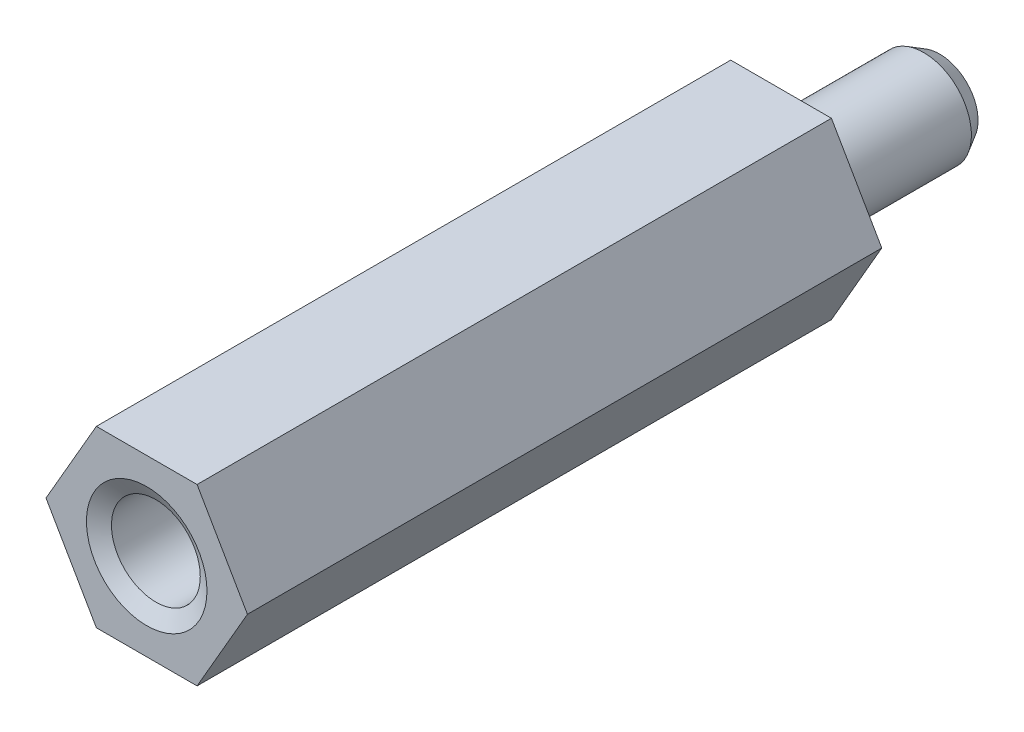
from build123d import *

# Parameters (mm, degrees)
BOSS_EXTRUDE1_DEPTH = 20
SKETCH2_R           = 1.5
BOSS_EXTRUDE2_DEPTH = 5
CHAMFER1_SIZE       = 0.5
CHAMFER1_SIZE2      = 0.288675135
SKETCH3_R           = 1.4
CUT_EXTRUDE1_DEPTH  = 6
CHAMFER2_SIZE       = 1.2
CHAMFER2_SIZE2      = 0.692820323
CHAMFER3_SIZE       = 0.5
CHAMFER3_SIZE2      = 0.288675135


with BuildPart() as part:
    # Sketch1 → Boss-Extrude1 (new body)
    with BuildSketch(Plane.XY):
        Polygon((1.58771324, 2.75), (-1.58771324, 2.75), (-3.175426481, 0), (-1.58771324, -2.75), (1.58771324, -2.75), (3.175426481, 0), align=None)
    extrude(amount=BOSS_EXTRUDE1_DEPTH)

    # Sketch2 → Boss-Extrude2 (add)
    with BuildSketch(Plane(origin=(0, 0, 0), x_dir=(-1, 0, 0), z_dir=(0, 0, -1))):
        Circle(SKETCH2_R)
    extrude(amount=BOSS_EXTRUDE2_DEPTH)

    # Chamfer1
    chamfer1_edges = [part.edges().sort_by_distance(p)[0] for p in [
        (1.5, 0, -5),
    ]]
    chamfer1_side = [part.faces().sort_by_distance(p)[0] for p in [
        (1.5, 0, -2.5),
    ]]
    chamfer(chamfer1_edges, length=CHAMFER1_SIZE, length2=CHAMFER1_SIZE2, reference=chamfer1_side[0])

    # Sketch3 → Cut-Extrude1 (cut)
    with BuildSketch(Plane.XY.offset(20)):
        Circle(SKETCH3_R)
    extrude(amount=-CUT_EXTRUDE1_DEPTH, mode=Mode.SUBTRACT)

    # Chamfer2
    chamfer2_edges = [part.edges().sort_by_distance(p)[0] for p in [
        (-1.4, 0, 14),
    ]]
    chamfer2_side = [part.faces().sort_by_distance(p)[0] for p in [
        (0, 0, 14),
    ]]
    chamfer(chamfer2_edges, length=CHAMFER2_SIZE, length2=CHAMFER2_SIZE2, reference=chamfer2_side[0])

    # Chamfer3
    chamfer3_edges = [part.edges().sort_by_distance(p)[0] for p in [
        (-1.4, 0, 20),
    ]]
    chamfer3_side = [part.faces().sort_by_distance(p)[0] for p in [
        (0, 2.665986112, 20),
    ]]
    chamfer(chamfer3_edges, length=CHAMFER3_SIZE, length2=CHAMFER3_SIZE2, reference=chamfer3_side[0])


solid = part.part
